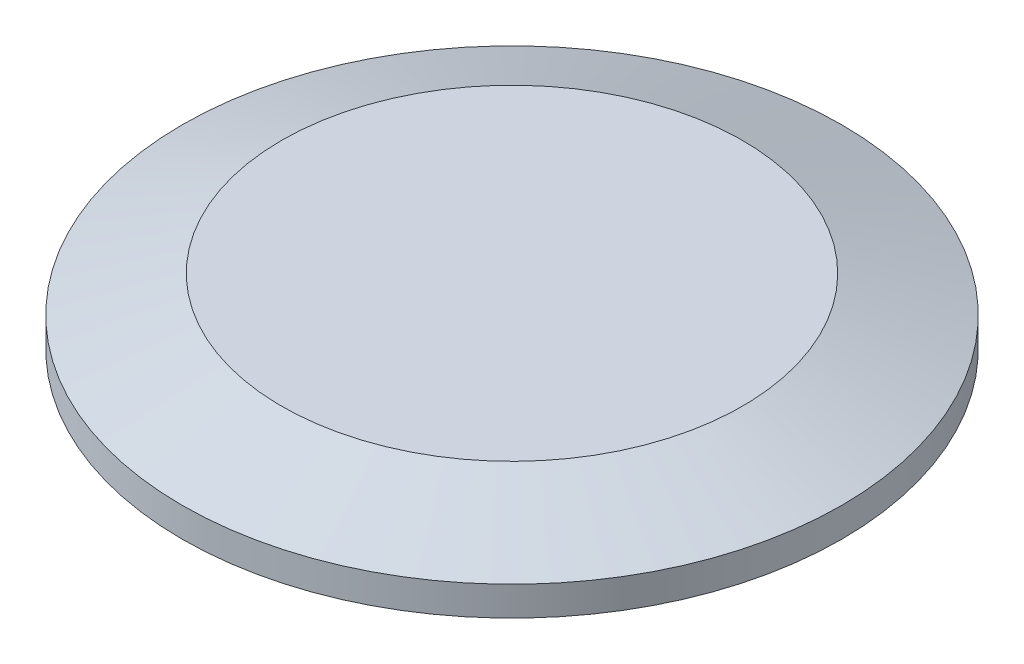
ISO-10303-21;
HEADER;
FILE_DESCRIPTION(('STEP AP214'),'2;1');
FILE_NAME('part.step','',(''),(''),'','','');
FILE_SCHEMA(('AUTOMOTIVE_DESIGN { 1 0 10303 214 1 1 1 1 }'));
ENDSEC;
DATA;
#1=APPLICATION_CONTEXT('core data for automotive mechanical design processes');
#2=APPLICATION_PROTOCOL_DEFINITION('international standard','automotive_design',2000,#1);
#3=PRODUCT_CONTEXT('',#1,'mechanical');
#4=PRODUCT('Part','Part','',(#3));
#5=PRODUCT_RELATED_PRODUCT_CATEGORY('part','',(#4));
#6=PRODUCT_DEFINITION_FORMATION('','',#4);
#7=PRODUCT_DEFINITION_CONTEXT('part definition',#1,'design');
#8=PRODUCT_DEFINITION('design','',#6,#7);
#9=PRODUCT_DEFINITION_SHAPE('','',#8);
#10=(LENGTH_UNIT() NAMED_UNIT(*) SI_UNIT(.MILLI.,.METRE.));
#11=(NAMED_UNIT(*) PLANE_ANGLE_UNIT() SI_UNIT($,.RADIAN.));
#12=(NAMED_UNIT(*) SI_UNIT($,.STERADIAN.) SOLID_ANGLE_UNIT());
#13=UNCERTAINTY_MEASURE_WITH_UNIT(LENGTH_MEASURE(1.E-05),#10,'distance_accuracy_value','');
#14=(GEOMETRIC_REPRESENTATION_CONTEXT(3) GLOBAL_UNCERTAINTY_ASSIGNED_CONTEXT((#13)) GLOBAL_UNIT_ASSIGNED_CONTEXT((#10,
#11,#12)) REPRESENTATION_CONTEXT('',''));
#15=CARTESIAN_POINT('',(0.,0.,0.));
#16=DIRECTION('',(0.,0.,1.));
#17=DIRECTION('',(1.,0.,0.));
#18=AXIS2_PLACEMENT_3D('',#15,#16,#17);
#19=CARTESIAN_POINT('',(-22.3227421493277,6.35,0.));
#20=DIRECTION('',(0.,1.,0.));
#21=DIRECTION('',(-1.,0.,0.));
#22=AXIS2_PLACEMENT_3D('',#19,#20,#21);
#23=PLANE('',#22);
#24=CARTESIAN_POINT('',(0.,6.35,0.));
#25=DIRECTION('',(0.,1.,0.));
#26=DIRECTION('',(-1.,0.,0.));
#27=AXIS2_PLACEMENT_3D('',#24,#25,#26);
#28=CIRCLE('',#27,22.3227421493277);
#29=CARTESIAN_POINT('',(-22.3227421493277,6.35,0.));
#30=VERTEX_POINT('',#29);
#31=EDGE_CURVE('E10',#30,#30,#28,.T.);
#32=ORIENTED_EDGE('',*,*,#31,.T.);
#33=EDGE_LOOP('',(#32));
#34=FACE_BOUND('',#33,.T.);
#35=ADVANCED_FACE('F30',(#34),#23,.T.);
#36=CARTESIAN_POINT('',(0.,6.35,0.));
#37=DIRECTION('',(0.,-1.,0.));
#38=DIRECTION('',(1.,0.,0.));
#39=AXIS2_PLACEMENT_3D('',#36,#37,#38);
#40=CONICAL_SURFACE('',#39,22.3227421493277,1.22173047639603);
#41=CARTESIAN_POINT('',(0.,2.8448,0.));
#42=DIRECTION('',(0.,1.,0.));
#43=DIRECTION('',(-1.,0.,0.));
#44=AXIS2_PLACEMENT_3D('',#41,#42,#43);
#45=CIRCLE('',#44,31.9532);
#46=CARTESIAN_POINT('',(-31.9532,2.8448,0.));
#47=VERTEX_POINT('',#46);
#48=EDGE_CURVE('E36',#47,#47,#45,.T.);
#49=ORIENTED_EDGE('',*,*,#48,.T.);
#50=EDGE_LOOP('',(#49));
#51=FACE_BOUND('',#50,.T.);
#52=ORIENTED_EDGE('',*,*,#31,.F.);
#53=EDGE_LOOP('',(#52));
#54=FACE_BOUND('',#53,.T.);
#55=ADVANCED_FACE('F71',(#51,#54),#40,.T.);
#56=CARTESIAN_POINT('',(0.,6.35,0.));
#57=DIRECTION('',(0.,1.,0.));
#58=DIRECTION('',(-1.,0.,0.));
#59=AXIS2_PLACEMENT_3D('',#56,#57,#58);
#60=CYLINDRICAL_SURFACE('',#59,31.9532);
#61=CARTESIAN_POINT('',(0.,0.,0.));
#62=DIRECTION('',(0.,1.,0.));
#63=DIRECTION('',(-1.,0.,0.));
#64=AXIS2_PLACEMENT_3D('',#61,#62,#63);
#65=CIRCLE('',#64,31.9532);
#66=CARTESIAN_POINT('',(-31.9532,0.,0.));
#67=VERTEX_POINT('',#66);
#68=EDGE_CURVE('E40',#67,#67,#65,.T.);
#69=ORIENTED_EDGE('',*,*,#68,.T.);
#70=EDGE_LOOP('',(#69));
#71=FACE_BOUND('',#70,.T.);
#72=ORIENTED_EDGE('',*,*,#48,.F.);
#73=EDGE_LOOP('',(#72));
#74=FACE_BOUND('',#73,.T.);
#75=ADVANCED_FACE('F75',(#71,#74),#60,.T.);
#76=CARTESIAN_POINT('',(-29.9866084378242,0.,0.));
#77=DIRECTION('',(0.,-1.,0.));
#78=DIRECTION('',(1.,0.,0.));
#79=AXIS2_PLACEMENT_3D('',#76,#77,#78);
#80=PLANE('',#79);
#81=CARTESIAN_POINT('',(0.,0.,0.));
#82=DIRECTION('',(0.,1.,0.));
#83=DIRECTION('',(-1.,0.,0.));
#84=AXIS2_PLACEMENT_3D('',#81,#82,#83);
#85=CIRCLE('',#84,29.9866084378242);
#86=CARTESIAN_POINT('',(-29.9866084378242,0.,0.));
#87=VERTEX_POINT('',#86);
#88=EDGE_CURVE('E44',#87,#87,#85,.T.);
#89=ORIENTED_EDGE('',*,*,#88,.T.);
#90=EDGE_LOOP('',(#89));
#91=FACE_BOUND('',#90,.T.);
#92=ORIENTED_EDGE('',*,*,#68,.F.);
#93=EDGE_LOOP('',(#92));
#94=FACE_BOUND('',#93,.T.);
#95=ADVANCED_FACE('F79',(#91,#94),#80,.T.);
#96=CARTESIAN_POINT('',(0.,0.787399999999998,0.));
#97=DIRECTION('',(0.,1.,0.));
#98=DIRECTION('',(-1.,0.,0.));
#99=AXIS2_PLACEMENT_3D('',#96,#97,#98);
#100=TOROIDAL_SURFACE('',#99,29.9866084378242,0.787400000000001);
#101=CARTESIAN_POINT('',(0.,0.474458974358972,0.));
#102=DIRECTION('',(0.,1.,0.));
#103=DIRECTION('',(-1.,0.,0.));
#104=AXIS2_PLACEMENT_3D('',#101,#102,#103);
#105=CIRCLE('',#104,29.2640666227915);
#106=CARTESIAN_POINT('',(-29.2640666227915,0.474458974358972,0.));
#107=VERTEX_POINT('',#106);
#108=EDGE_CURVE('E49',#107,#107,#105,.T.);
#109=ORIENTED_EDGE('',*,*,#108,.T.);
#110=EDGE_LOOP('',(#109));
#111=FACE_BOUND('',#110,.T.);
#112=ORIENTED_EDGE('',*,*,#88,.F.);
#113=EDGE_LOOP('',(#112));
#114=FACE_BOUND('',#113,.T.);
#115=ADVANCED_FACE('F86',(#111,#114),#100,.T.);
#116=CARTESIAN_POINT('',(0.,0.,0.));
#117=DIRECTION('',(0.,1.,0.));
#118=DIRECTION('',(-1.,0.,0.));
#119=AXIS2_PLACEMENT_3D('',#116,#117,#118);
#120=TOROIDAL_SURFACE('',#119,28.1686,1.1938);
#121=CARTESIAN_POINT('',(0.,0.47445897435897,0.));
#122=DIRECTION('',(0.,1.,0.));
#123=DIRECTION('',(-1.,0.,0.));
#124=AXIS2_PLACEMENT_3D('',#121,#122,#123);
#125=CIRCLE('',#124,27.0731333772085);
#126=CARTESIAN_POINT('',(-27.0731333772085,0.47445897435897,0.));
#127=VERTEX_POINT('',#126);
#128=EDGE_CURVE('E52',#127,#127,#125,.T.);
#129=ORIENTED_EDGE('',*,*,#128,.T.);
#130=EDGE_LOOP('',(#129));
#131=FACE_BOUND('',#130,.T.);
#132=ORIENTED_EDGE('',*,*,#108,.F.);
#133=EDGE_LOOP('',(#132));
#134=FACE_BOUND('',#133,.T.);
#135=ADVANCED_FACE('F68',(#131,#134),#120,.F.);
#136=CARTESIAN_POINT('',(0.,0.787399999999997,0.));
#137=DIRECTION('',(0.,1.,0.));
#138=DIRECTION('',(-1.,0.,0.));
#139=AXIS2_PLACEMENT_3D('',#136,#137,#138);
#140=TOROIDAL_SURFACE('',#139,26.3505915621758,0.787399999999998);
#141=CARTESIAN_POINT('',(0.,0.,0.));
#142=DIRECTION('',(0.,1.,0.));
#143=DIRECTION('',(-1.,0.,0.));
#144=AXIS2_PLACEMENT_3D('',#141,#142,#143);
#145=CIRCLE('',#144,26.3505915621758);
#146=CARTESIAN_POINT('',(-26.3505915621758,0.,0.));
#147=VERTEX_POINT('',#146);
#148=EDGE_CURVE('E55',#147,#147,#145,.T.);
#149=ORIENTED_EDGE('',*,*,#148,.T.);
#150=EDGE_LOOP('',(#149));
#151=FACE_BOUND('',#150,.T.);
#152=ORIENTED_EDGE('',*,*,#128,.F.);
#153=EDGE_LOOP('',(#152));
#154=FACE_BOUND('',#153,.T.);
#155=ADVANCED_FACE('F59',(#151,#154),#140,.T.);
#156=CARTESIAN_POINT('',(0.,0.,0.));
#157=DIRECTION('',(0.,-1.,0.));
#158=DIRECTION('',(1.,0.,0.));
#159=AXIS2_PLACEMENT_3D('',#156,#157,#158);
#160=PLANE('',#159);
#161=ORIENTED_EDGE('',*,*,#148,.F.);
#162=EDGE_LOOP('',(#161));
#163=FACE_BOUND('',#162,.T.);
#164=ADVANCED_FACE('F62',(#163),#160,.T.);
#165=CLOSED_SHELL('',(#35,#55,#75,#95,#115,#135,#155,#164));
#166=MANIFOLD_SOLID_BREP('B2',#165);
#167=ADVANCED_BREP_SHAPE_REPRESENTATION('',(#18,#166),#14);
#168=SHAPE_DEFINITION_REPRESENTATION(#9,#167);
ENDSEC;
END-ISO-10303-21;
